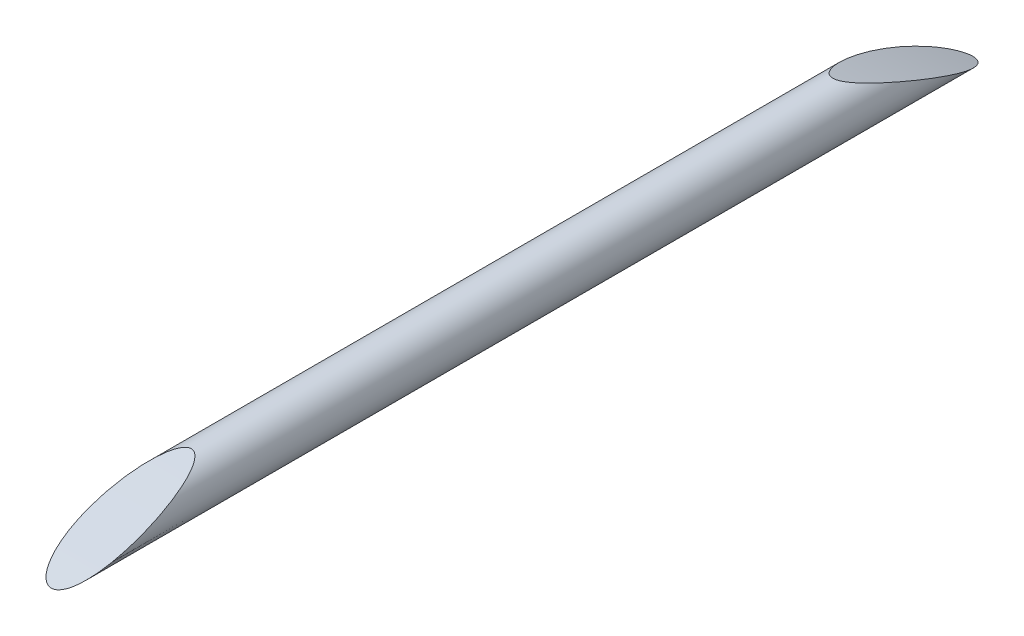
ISO-10303-21;
HEADER;
FILE_DESCRIPTION(('STEP AP214'),'2;1');
FILE_NAME('part.step','',(''),(''),'','','');
FILE_SCHEMA(('AUTOMOTIVE_DESIGN { 1 0 10303 214 1 1 1 1 }'));
ENDSEC;
DATA;
#1=APPLICATION_CONTEXT('core data for automotive mechanical design processes');
#2=APPLICATION_PROTOCOL_DEFINITION('international standard','automotive_design',2000,#1);
#3=PRODUCT_CONTEXT('',#1,'mechanical');
#4=PRODUCT('Part','Part','',(#3));
#5=PRODUCT_RELATED_PRODUCT_CATEGORY('part','',(#4));
#6=PRODUCT_DEFINITION_FORMATION('','',#4);
#7=PRODUCT_DEFINITION_CONTEXT('part definition',#1,'design');
#8=PRODUCT_DEFINITION('design','',#6,#7);
#9=PRODUCT_DEFINITION_SHAPE('','',#8);
#10=(LENGTH_UNIT() NAMED_UNIT(*) SI_UNIT(.MILLI.,.METRE.));
#11=(NAMED_UNIT(*) PLANE_ANGLE_UNIT() SI_UNIT($,.RADIAN.));
#12=(NAMED_UNIT(*) SI_UNIT($,.STERADIAN.) SOLID_ANGLE_UNIT());
#13=UNCERTAINTY_MEASURE_WITH_UNIT(LENGTH_MEASURE(1.E-05),#10,'distance_accuracy_value','');
#14=(GEOMETRIC_REPRESENTATION_CONTEXT(3) GLOBAL_UNCERTAINTY_ASSIGNED_CONTEXT((#13)) GLOBAL_UNIT_ASSIGNED_CONTEXT((#10,
#11,#12)) REPRESENTATION_CONTEXT('',''));
#15=CARTESIAN_POINT('',(0.,0.,0.));
#16=DIRECTION('',(0.,0.,1.));
#17=DIRECTION('',(1.,0.,0.));
#18=AXIS2_PLACEMENT_3D('',#15,#16,#17);
#19=CARTESIAN_POINT('',(0.,0.,10.5));
#20=DIRECTION('',(0.,0.,-1.));
#21=DIRECTION('',(-1.,0.,0.));
#22=AXIS2_PLACEMENT_3D('',#19,#20,#21);
#23=CYLINDRICAL_SURFACE('',#22,0.5);
#24=CARTESIAN_POINT('',(-0.5,0.,7.81348853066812));
#25=CARTESIAN_POINT('',(-0.500001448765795,0.0291573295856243,7.73475115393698));
#26=CARTESIAN_POINT('',(-0.497465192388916,0.0578744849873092,7.65584777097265));
#27=CARTESIAN_POINT('',(-0.487597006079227,0.11432442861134,7.49800798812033));
#28=CARTESIAN_POINT('',(-0.48026587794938,0.142057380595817,7.41907159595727));
#29=CARTESIAN_POINT('',(-0.46063378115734,0.196628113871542,7.26094847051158));
#30=CARTESIAN_POINT('',(-0.448302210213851,0.223459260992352,7.1817632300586));
#31=CARTESIAN_POINT('',(-0.418091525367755,0.275902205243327,7.02413147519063));
#32=CARTESIAN_POINT('',(-0.400220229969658,0.301515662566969,6.94568407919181));
#33=CARTESIAN_POINT('',(-0.367957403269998,0.338935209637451,6.82894699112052));
#34=CARTESIAN_POINT('',(-0.356254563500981,0.351273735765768,6.79008609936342));
#35=CARTESIAN_POINT('',(-0.330563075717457,0.375556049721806,6.7128923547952));
#36=CARTESIAN_POINT('',(-0.316569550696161,0.387498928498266,6.67456082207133));
#37=CARTESIAN_POINT('',(-0.285748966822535,0.410756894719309,6.59921824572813));
#38=CARTESIAN_POINT('',(-0.268947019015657,0.422076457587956,6.56219874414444));
#39=CARTESIAN_POINT('',(-0.240598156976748,0.438439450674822,6.50821051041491));
#40=CARTESIAN_POINT('',(-0.230644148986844,0.443782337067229,6.49050060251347));
#41=CARTESIAN_POINT('',(-0.209393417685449,0.454197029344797,6.45583050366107));
#42=CARTESIAN_POINT('',(-0.198098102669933,0.459269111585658,6.43886955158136));
#43=CARTESIAN_POINT('',(-0.173629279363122,0.46907284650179,6.40595294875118));
#44=CARTESIAN_POINT('',(-0.16043786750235,0.473800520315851,6.39000925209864));
#45=CARTESIAN_POINT('',(-0.131668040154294,0.482585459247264,6.36027398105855));
#46=CARTESIAN_POINT('',(-0.116107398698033,0.486647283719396,6.34646780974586));
#47=CARTESIAN_POINT('',(-0.0914505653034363,0.491625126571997,6.32950276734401));
#48=CARTESIAN_POINT('',(-0.0835964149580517,0.493031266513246,6.32470327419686));
#49=CARTESIAN_POINT('',(-0.0672596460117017,0.495524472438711,6.31618509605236));
#50=CARTESIAN_POINT('',(-0.0587769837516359,0.496611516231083,6.31246648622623));
#51=CARTESIAN_POINT('',(-0.0411612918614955,0.49838212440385,6.3064057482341));
#52=CARTESIAN_POINT('',(-0.0320216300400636,0.499060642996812,6.30408083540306));
#53=CARTESIAN_POINT('',(-0.013449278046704,0.499905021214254,6.30118717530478));
#54=CARTESIAN_POINT('',(-0.00401712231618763,0.500071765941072,6.30061539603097));
#55=CARTESIAN_POINT('',(0.0136701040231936,0.499882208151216,6.30126516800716));
#56=CARTESIAN_POINT('',(0.0219340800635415,0.499584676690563,6.30228521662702));
#57=CARTESIAN_POINT('',(0.0381699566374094,0.498607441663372,6.30563344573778));
#58=CARTESIAN_POINT('',(0.0461415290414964,0.497927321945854,6.30796305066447));
#59=CARTESIAN_POINT('',(0.0645042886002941,0.495936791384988,6.31477496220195));
#60=CARTESIAN_POINT('',(0.0747008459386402,0.49448633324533,6.31973466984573));
#61=CARTESIAN_POINT('',(0.0941618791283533,0.491153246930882,6.33111260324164));
#62=CARTESIAN_POINT('',(0.103423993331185,0.489269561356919,6.33753439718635));
#63=CARTESIAN_POINT('',(0.128190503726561,0.483566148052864,6.3569399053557));
#64=CARTESIAN_POINT('',(0.14272321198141,0.479407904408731,6.37104681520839));
#65=CARTESIAN_POINT('',(0.169665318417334,0.470546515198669,6.40098514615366));
#66=CARTESIAN_POINT('',(0.18206788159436,0.465841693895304,6.41682186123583));
#67=CARTESIAN_POINT('',(0.211578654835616,0.453446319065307,6.4583643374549));
#68=CARTESIAN_POINT('',(0.227594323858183,0.44551950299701,6.48476721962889));
#69=CARTESIAN_POINT('',(0.257083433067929,0.429173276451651,6.53883186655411));
#70=CARTESIAN_POINT('',(0.270550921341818,0.420752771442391,6.56649639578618));
#71=CARTESIAN_POINT('',(0.295646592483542,0.403516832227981,6.62272138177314));
#72=CARTESIAN_POINT('',(0.307264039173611,0.394699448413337,6.65128599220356));
#73=CARTESIAN_POINT('',(0.328967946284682,0.376798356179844,6.7088623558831));
#74=CARTESIAN_POINT('',(0.33905600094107,0.367714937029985,6.73787360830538));
#75=CARTESIAN_POINT('',(0.363256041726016,0.344192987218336,6.81246121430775));
#76=CARTESIAN_POINT('',(0.376483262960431,0.32958732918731,6.85827172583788));
#77=CARTESIAN_POINT('',(0.40053203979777,0.299894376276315,6.95036837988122));
#78=CARTESIAN_POINT('',(0.41135274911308,0.284806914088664,6.99665468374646));
#79=CARTESIAN_POINT('',(0.440779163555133,0.238845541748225,7.13610338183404));
#80=CARTESIAN_POINT('',(0.456304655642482,0.207318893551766,7.2297087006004));
#81=CARTESIAN_POINT('',(0.480375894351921,0.142866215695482,7.4169465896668));
#82=CARTESIAN_POINT('',(0.488944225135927,0.109945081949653,7.51057807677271));
#83=CARTESIAN_POINT('',(0.49933113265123,0.0427370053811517,7.69773825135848));
#84=CARTESIAN_POINT('',(0.501150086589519,0.00845013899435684,7.7912669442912));
#85=CARTESIAN_POINT('',(0.497784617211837,-0.0550330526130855,7.96094278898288));
#86=CARTESIAN_POINT('',(0.493802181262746,-0.0840344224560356,8.03718748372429));
#87=CARTESIAN_POINT('',(0.480147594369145,-0.142729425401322,8.18901450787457));
#88=CARTESIAN_POINT('',(0.470470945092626,-0.172423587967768,8.2645962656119));
#89=CARTESIAN_POINT('',(0.45027242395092,-0.218057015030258,8.37894755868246));
#90=CARTESIAN_POINT('',(0.442313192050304,-0.233861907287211,8.41822671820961));
#91=CARTESIAN_POINT('',(0.424080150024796,-0.265500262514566,8.49622611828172));
#92=CARTESIAN_POINT('',(0.413807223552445,-0.28133371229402,8.53494656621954));
#93=CARTESIAN_POINT('',(0.390477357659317,-0.312910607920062,8.61156646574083));
#94=CARTESIAN_POINT('',(0.377421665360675,-0.328654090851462,8.64946627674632));
#95=CARTESIAN_POINT('',(0.347819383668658,-0.359840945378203,8.72398115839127));
#96=CARTESIAN_POINT('',(0.331278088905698,-0.375284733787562,8.76059808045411));
#97=CARTESIAN_POINT('',(0.296744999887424,-0.402920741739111,8.82566387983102));
#98=CARTESIAN_POINT('',(0.279473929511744,-0.415220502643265,8.85444545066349));
#99=CARTESIAN_POINT('',(0.240711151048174,-0.438833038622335,8.90940169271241));
#100=CARTESIAN_POINT('',(0.219243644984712,-0.450150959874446,8.93559007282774));
#101=CARTESIAN_POINT('',(0.184263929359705,-0.464949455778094,8.96968174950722));
#102=CARTESIAN_POINT('',(0.173068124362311,-0.469257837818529,8.97958506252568));
#103=CARTESIAN_POINT('',(0.149414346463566,-0.477317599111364,8.99807948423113));
#104=CARTESIAN_POINT('',(0.13695511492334,-0.481068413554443,9.00666926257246));
#105=CARTESIAN_POINT('',(0.110538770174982,-0.487821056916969,9.02211225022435));
#106=CARTESIAN_POINT('',(0.0965631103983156,-0.490811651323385,9.02893943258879));
#107=CARTESIAN_POINT('',(0.0674345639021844,-0.495649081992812,9.03997314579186));
#108=CARTESIAN_POINT('',(0.0522858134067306,-0.49749974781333,9.04418845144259));
#109=CARTESIAN_POINT('',(0.0254925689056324,-0.499479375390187,9.04869637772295));
#110=CARTESIAN_POINT('',(0.0139969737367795,-0.499936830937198,9.04973751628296));
#111=CARTESIAN_POINT('',(-0.0090201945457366,-0.500050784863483,9.04999691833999));
#112=CARTESIAN_POINT('',(-0.0205417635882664,-0.499707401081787,9.04921545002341));
#113=CARTESIAN_POINT('',(-0.0432373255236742,-0.498256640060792,9.04591212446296));
#114=CARTESIAN_POINT('',(-0.0544123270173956,-0.497151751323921,9.04339593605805));
#115=CARTESIAN_POINT('',(-0.0762163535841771,-0.494279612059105,9.03684981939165));
#116=CARTESIAN_POINT('',(-0.0868449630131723,-0.492511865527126,9.03281875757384));
#117=CARTESIAN_POINT('',(-0.112816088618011,-0.487368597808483,9.02107774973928));
#118=CARTESIAN_POINT('',(-0.127714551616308,-0.483635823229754,9.0125465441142));
#119=CARTESIAN_POINT('',(-0.155888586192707,-0.475305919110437,8.99346806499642));
#120=CARTESIAN_POINT('',(-0.169159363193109,-0.470706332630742,8.98291505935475));
#121=CARTESIAN_POINT('',(-0.203767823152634,-0.457212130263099,8.95187924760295));
#122=CARTESIAN_POINT('',(-0.223557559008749,-0.447713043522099,8.92995207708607));
#123=CARTESIAN_POINT('',(-0.259619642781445,-0.427809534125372,8.88378133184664));
#124=CARTESIAN_POINT('',(-0.275882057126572,-0.417402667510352,8.85953148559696));
#125=CARTESIAN_POINT('',(-0.307073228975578,-0.395103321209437,8.80730018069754));
#126=CARTESIAN_POINT('',(-0.321735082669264,-0.383162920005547,8.77918182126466));
#127=CARTESIAN_POINT('',(-0.348516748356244,-0.358970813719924,8.72187502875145));
#128=CARTESIAN_POINT('',(-0.360633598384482,-0.346718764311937,8.69268539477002));
#129=CARTESIAN_POINT('',(-0.393946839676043,-0.309706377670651,8.60396617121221));
#130=CARTESIAN_POINT('',(-0.412059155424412,-0.284726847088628,8.54337285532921));
#131=CARTESIAN_POINT('',(-0.440665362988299,-0.237646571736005,8.4277019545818));
#132=CARTESIAN_POINT('',(-0.451787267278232,-0.21553824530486,8.37277113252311));
#133=CARTESIAN_POINT('',(-0.470262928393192,-0.171532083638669,8.26216004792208));
#134=CARTESIAN_POINT('',(-0.477614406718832,-0.149634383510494,8.20647935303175));
#135=CARTESIAN_POINT('',(-0.489104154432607,-0.106207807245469,8.09474086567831));
#136=CARTESIAN_POINT('',(-0.493246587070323,-0.0846784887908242,8.03868365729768));
#137=CARTESIAN_POINT('',(-0.498694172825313,-0.0420240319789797,7.92627559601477));
#138=CARTESIAN_POINT('',(-0.499998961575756,-0.0208989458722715,7.86992470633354));
#139=CARTESIAN_POINT('',(-0.5,0.,7.81348853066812));
#140=B_SPLINE_CURVE_WITH_KNOTS('',3,(#24,#25,#26,#27,#28,#29,#30,#31,#32,#33,#34,#35,#36,#37,
#38,#39,#40,#41,#42,#43,#44,#45,#46,#47,#48,#49,#50,#51,#52,#53,#54,#55,#56,#57,#58,#59,#60,#61,
#62,#63,#64,#65,#66,#67,#68,#69,#70,#71,#72,#73,#74,#75,#76,#77,#78,#79,#80,#81,#82,#83,#84,#85,
#86,#87,#88,#89,#90,#91,#92,#93,#94,#95,#96,#97,#98,#99,#100,#101,#102,#103,#104,#105,#106,#107,
#108,#109,#110,#111,#112,#113,#114,#115,#116,#117,#118,#119,#120,#121,#122,#123,#124,#125,#126,
#127,#128,#129,#130,#131,#132,#133,#134,#135,#136,#137,#138,#139),.UNSPECIFIED.,.T.,.F.,(4,2,2,
2,2,2,2,2,2,2,2,2,2,2,2,2,2,2,2,2,2,2,2,2,2,2,2,2,2,2,2,2,2,2,2,2,2,2,2,2,2,2,2,2,2,2,2,2,2,2,2,
2,2,2,2,2,2,4),(0.,0.251859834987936,0.503677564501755,0.757060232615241,1.01008690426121,
1.13729267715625,1.26477288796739,1.39116889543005,1.45414921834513,1.51706399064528,
1.58061748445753,1.64371576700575,1.67158102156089,1.69944821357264,1.72765289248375,
1.75580876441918,1.78067871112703,1.80557576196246,1.83967454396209,1.87385745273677,
1.93553646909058,1.99740984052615,2.09281557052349,2.1884414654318,2.28460352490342,
2.38066464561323,2.53018231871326,2.6797524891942,2.97937197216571,3.27801490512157,
3.5766411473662,3.82149991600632,4.06655237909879,4.19574643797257,4.32489123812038,
4.45397828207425,4.58287063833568,4.68992252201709,4.79637431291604,4.84295482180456,
4.88958219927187,4.93686310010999,4.98398428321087,5.0184770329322,5.05296470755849,
5.08734021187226,5.12174149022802,5.17414641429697,5.22670217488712,5.31925926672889,
5.41207372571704,5.51356711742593,5.61517798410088,5.81871252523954,5.99933944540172,
6.18007539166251,6.36057646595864,6.54110071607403),.UNSPECIFIED.);
#141=CARTESIAN_POINT('',(-0.5,0.,7.81348853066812));
#142=VERTEX_POINT('',#141);
#143=EDGE_CURVE('E10',#142,#142,#140,.T.);
#144=ORIENTED_EDGE('',*,*,#143,.T.);
#145=EDGE_LOOP('',(#144));
#146=FACE_BOUND('',#145,.T.);
#147=CARTESIAN_POINT('',(-0.5,0.,-7.81348853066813));
#148=CARTESIAN_POINT('',(-0.499998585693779,-0.0247696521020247,-7.8803773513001));
#149=CARTESIAN_POINT('',(-0.498168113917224,-0.0498572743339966,-7.94714693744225));
#150=CARTESIAN_POINT('',(-0.490451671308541,-0.10057849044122,-8.08021742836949));
#151=CARTESIAN_POINT('',(-0.484567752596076,-0.126211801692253,-8.14651855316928));
#152=CARTESIAN_POINT('',(-0.468076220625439,-0.17787611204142,-8.27829976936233));
#153=CARTESIAN_POINT('',(-0.457474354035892,-0.203906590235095,-8.34378076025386));
#154=CARTESIAN_POINT('',(-0.430425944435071,-0.256129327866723,-8.47339344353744));
#155=CARTESIAN_POINT('',(-0.413988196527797,-0.282321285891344,-8.53752701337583));
#156=CARTESIAN_POINT('',(-0.377896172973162,-0.328396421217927,-8.64891093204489));
#157=CARTESIAN_POINT('',(-0.359863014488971,-0.348338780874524,-8.69663793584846));
#158=CARTESIAN_POINT('',(-0.327998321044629,-0.377652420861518,-8.76614839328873));
#159=CARTESIAN_POINT('',(-0.316603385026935,-0.387303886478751,-8.78892592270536));
#160=CARTESIAN_POINT('',(-0.291853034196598,-0.406283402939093,-8.83352001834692));
#161=CARTESIAN_POINT('',(-0.278499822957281,-0.415611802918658,-8.85533762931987));
#162=CARTESIAN_POINT('',(-0.253854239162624,-0.430926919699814,-8.891009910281));
#163=CARTESIAN_POINT('',(-0.243199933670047,-0.437055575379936,-8.90524206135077));
#164=CARTESIAN_POINT('',(-0.220492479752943,-0.44894066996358,-8.93276834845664));
#165=CARTESIAN_POINT('',(-0.208437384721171,-0.454696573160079,-8.94606113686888));
#166=CARTESIAN_POINT('',(-0.182578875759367,-0.465687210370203,-8.97138209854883));
#167=CARTESIAN_POINT('',(-0.16875998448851,-0.470916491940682,-8.98339710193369));
#168=CARTESIAN_POINT('',(-0.139240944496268,-0.480469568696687,-9.00530223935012));
#169=CARTESIAN_POINT('',(-0.12354590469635,-0.484795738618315,-9.01519794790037));
#170=CARTESIAN_POINT('',(-0.0959642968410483,-0.490832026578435,-9.02898599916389));
#171=CARTESIAN_POINT('',(-0.0846147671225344,-0.492930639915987,-9.03377363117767));
#172=CARTESIAN_POINT('',(-0.0612255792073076,-0.496377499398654,-9.04163214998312));
#173=CARTESIAN_POINT('',(-0.049186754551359,-0.497726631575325,-9.04470506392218));
#174=CARTESIAN_POINT('',(-0.0246020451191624,-0.4995472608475,-9.04885100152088));
#175=CARTESIAN_POINT('',(-0.0120530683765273,-0.500012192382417,-9.04990906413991));
#176=CARTESIAN_POINT('',(0.0130399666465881,-0.4999873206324,-9.04985245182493));
#177=CARTESIAN_POINT('',(0.0255840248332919,-0.499497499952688,-9.04873773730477));
#178=CARTESIAN_POINT('',(0.0491366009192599,-0.497707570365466,-9.04466161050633));
#179=CARTESIAN_POINT('',(0.0601822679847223,-0.496483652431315,-9.04187382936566));
#180=CARTESIAN_POINT('',(0.0817006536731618,-0.493399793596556,-9.03484353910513));
#181=CARTESIAN_POINT('',(0.0921730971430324,-0.491539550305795,-9.03060033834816));
#182=CARTESIAN_POINT('',(0.118306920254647,-0.486077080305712,-9.01812669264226));
#183=CARTESIAN_POINT('',(0.13346271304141,-0.482089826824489,-9.00901001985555));
#184=CARTESIAN_POINT('',(0.162062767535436,-0.4732450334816,-8.9887412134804));
#185=CARTESIAN_POINT('',(0.175501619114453,-0.46838485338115,-8.97758290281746));
#186=CARTESIAN_POINT('',(0.210839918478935,-0.454035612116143,-8.94455453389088));
#187=CARTESIAN_POINT('',(0.231055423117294,-0.443918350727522,-8.92117561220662));
#188=CARTESIAN_POINT('',(0.267774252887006,-0.422781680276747,-8.87207745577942));
#189=CARTESIAN_POINT('',(0.284267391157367,-0.41175990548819,-8.8463520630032));
#190=CARTESIAN_POINT('',(0.316008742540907,-0.388035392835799,-8.79067342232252));
#191=CARTESIAN_POINT('',(0.33093558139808,-0.375278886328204,-8.76056214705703));
#192=CARTESIAN_POINT('',(0.358079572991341,-0.349468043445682,-8.69925075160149));
#193=CARTESIAN_POINT('',(0.370293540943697,-0.336413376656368,-8.66804940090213));
#194=CARTESIAN_POINT('',(0.403706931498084,-0.297014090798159,-8.57326677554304));
#195=CARTESIAN_POINT('',(0.421623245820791,-0.270479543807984,-8.5086131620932));
#196=CARTESIAN_POINT('',(0.454125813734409,-0.212321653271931,-8.36495946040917));
#197=CARTESIAN_POINT('',(0.467347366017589,-0.18073252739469,-8.2856566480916));
#198=CARTESIAN_POINT('',(0.486940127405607,-0.118157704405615,-8.12589757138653));
#199=CARTESIAN_POINT('',(0.493302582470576,-0.0871728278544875,-8.04543996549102));
#200=CARTESIAN_POINT('',(0.500268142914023,-0.0260403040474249,-7.88392503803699));
#201=CARTESIAN_POINT('',(0.500868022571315,0.00410686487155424,-7.80286740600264));
#202=CARTESIAN_POINT('',(0.496850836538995,0.0633992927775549,-7.64059085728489));
#203=CARTESIAN_POINT('',(0.492237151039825,0.0925451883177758,-7.5593720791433));
#204=CARTESIAN_POINT('',(0.475916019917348,0.157964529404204,-7.37372829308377));
#205=CARTESIAN_POINT('',(0.462556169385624,0.193890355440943,-7.26931474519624));
#206=CARTESIAN_POINT('',(0.435589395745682,0.246257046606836,-7.11344138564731));
#207=CARTESIAN_POINT('',(0.425449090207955,0.263455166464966,-7.06161989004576));
#208=CARTESIAN_POINT('',(0.402531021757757,0.297302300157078,-6.95838711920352));
#209=CARTESIAN_POINT('',(0.389754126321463,0.313951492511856,-6.90697571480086));
#210=CARTESIAN_POINT('',(0.360988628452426,0.346643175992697,-6.80478933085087));
#211=CARTESIAN_POINT('',(0.344996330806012,0.362684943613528,-6.75401515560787));
#212=CARTESIAN_POINT('',(0.308833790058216,0.393956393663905,-6.65382351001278));
#213=CARTESIAN_POINT('',(0.288676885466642,0.409188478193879,-6.60440226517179));
#214=CARTESIAN_POINT('',(0.255045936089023,0.430225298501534,-6.53534283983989));
#215=CARTESIAN_POINT('',(0.244188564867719,0.436514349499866,-6.5145856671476));
#216=CARTESIAN_POINT('',(0.220783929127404,0.448810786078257,-6.4737960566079));
#217=CARTESIAN_POINT('',(0.208229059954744,0.454816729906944,-6.45376742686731));
#218=CARTESIAN_POINT('',(0.180710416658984,0.466446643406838,-6.41479827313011));
#219=CARTESIAN_POINT('',(0.165711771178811,0.472063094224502,-6.39587989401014));
#220=CARTESIAN_POINT('',(0.132527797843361,0.482427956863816,-6.36081535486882));
#221=CARTESIAN_POINT('',(0.11437368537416,0.487184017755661,-6.34464485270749));
#222=CARTESIAN_POINT('',(0.0865667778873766,0.49250757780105,-6.32649156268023));
#223=CARTESIAN_POINT('',(0.0787397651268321,0.493829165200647,-6.32197838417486));
#224=CARTESIAN_POINT('',(0.0624921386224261,0.496147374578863,-6.31405475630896));
#225=CARTESIAN_POINT('',(0.0540718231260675,0.497144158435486,-6.31064375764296));
#226=CARTESIAN_POINT('',(0.036638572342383,0.498733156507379,-6.30520325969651));
#227=CARTESIAN_POINT('',(0.0276199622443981,0.499320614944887,-6.30319000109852));
#228=CARTESIAN_POINT('',(0.00934827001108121,0.499995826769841,-6.30087582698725));
#229=CARTESIAN_POINT('',(9.54702561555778E-05,0.500084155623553,-6.30057293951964));
#230=CARTESIAN_POINT('',(-0.017271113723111,0.499768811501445,-6.30165387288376));
#231=CARTESIAN_POINT('',(-0.0253981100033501,0.499418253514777,-6.30285560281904));
#232=CARTESIAN_POINT('',(-0.0413407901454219,0.498352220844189,-6.30650762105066));
#233=CARTESIAN_POINT('',(-0.0491561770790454,0.497636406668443,-6.30895907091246));
#234=CARTESIAN_POINT('',(-0.0675544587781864,0.49553485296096,-6.31614957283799));
#235=CARTESIAN_POINT('',(-0.0779104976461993,0.493993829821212,-6.3214175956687));
#236=CARTESIAN_POINT('',(-0.0976459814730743,0.490475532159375,-6.33342366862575));
#237=CARTESIAN_POINT('',(-0.107022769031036,0.488497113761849,-6.34016557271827));
#238=CARTESIAN_POINT('',(-0.132334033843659,0.482465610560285,-6.36067700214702));
#239=CARTESIAN_POINT('',(-0.147218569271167,0.478057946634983,-6.37561959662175));
#240=CARTESIAN_POINT('',(-0.174766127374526,0.468686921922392,-6.40725061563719));
#241=CARTESIAN_POINT('',(-0.187421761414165,0.463721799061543,-6.42394456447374));
#242=CARTESIAN_POINT('',(-0.217804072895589,0.450525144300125,-6.46811274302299));
#243=CARTESIAN_POINT('',(-0.234331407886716,0.442039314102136,-6.49632721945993));
#244=CARTESIAN_POINT('',(-0.264689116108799,0.424550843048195,-6.5540404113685));
#245=CARTESIAN_POINT('',(-0.278513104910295,0.415547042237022,-6.58354197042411));
#246=CARTESIAN_POINT('',(-0.304203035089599,0.397128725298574,-6.64343622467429));
#247=CARTESIAN_POINT('',(-0.316059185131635,0.387712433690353,-6.67383253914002));
#248=CARTESIAN_POINT('',(-0.338155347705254,0.36859659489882,-6.73507072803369));
#249=CARTESIAN_POINT('',(-0.348397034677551,0.358897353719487,-6.76591210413));
#250=CARTESIAN_POINT('',(-0.370774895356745,0.335950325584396,-6.83832515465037));
#251=CARTESIAN_POINT('',(-0.382393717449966,0.32260383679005,-6.88002504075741));
#252=CARTESIAN_POINT('',(-0.403687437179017,0.295519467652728,-6.96379487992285));
#253=CARTESIAN_POINT('',(-0.413361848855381,0.281781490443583,-7.0058649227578));
#254=CARTESIAN_POINT('',(-0.439881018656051,0.239999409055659,-7.1325348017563));
#255=CARTESIAN_POINT('',(-0.454192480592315,0.211418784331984,-7.21749446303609));
#256=CARTESIAN_POINT('',(-0.477030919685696,0.153030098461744,-7.38765769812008));
#257=CARTESIAN_POINT('',(-0.485562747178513,0.123223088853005,-7.47286100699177));
#258=CARTESIAN_POINT('',(-0.497049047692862,0.0624488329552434,-7.64326992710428));
#259=CARTESIAN_POINT('',(-0.500001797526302,0.0314812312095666,-7.72847553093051));
#260=CARTESIAN_POINT('',(-0.5,0.,-7.81348853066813));
#261=B_SPLINE_CURVE_WITH_KNOTS('',3,(#147,#148,#149,#150,#151,#152,#153,#154,#155,#156,#157,
#158,#159,#160,#161,#162,#163,#164,#165,#166,#167,#168,#169,#170,#171,#172,#173,#174,#175,#176,
#177,#178,#179,#180,#181,#182,#183,#184,#185,#186,#187,#188,#189,#190,#191,#192,#193,#194,#195,
#196,#197,#198,#199,#200,#201,#202,#203,#204,#205,#206,#207,#208,#209,#210,#211,#212,#213,#214,
#215,#216,#217,#218,#219,#220,#221,#222,#223,#224,#225,#226,#227,#228,#229,#230,#231,#232,#233,
#234,#235,#236,#237,#238,#239,#240,#241,#242,#243,#244,#245,#246,#247,#248,#249,#250,#251,#252,
#253,#254,#255,#256,#257,#258,#259,#260),.UNSPECIFIED.,.T.,.F.,(4,2,2,2,2,2,2,2,2,2,2,2,2,2,2,2,
2,2,2,2,2,2,2,2,2,2,2,2,2,2,2,2,2,2,2,2,2,2,2,2,2,2,2,2,2,2,2,2,2,2,2,2,2,2,2,2,4),(0.,
0.213951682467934,0.427795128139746,0.641378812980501,0.854641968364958,1.01862230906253,
1.10026817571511,1.18182286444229,1.2381786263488,1.29461366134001,1.3515832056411,
1.40840100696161,1.44575614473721,1.48306702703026,1.52065389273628,1.55824144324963,
1.59247551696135,1.6267258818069,1.68080320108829,1.73504692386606,1.83206078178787,
1.92933699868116,2.03700826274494,2.1448052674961,2.36077932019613,2.61957748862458,
2.87870556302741,3.13797868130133,3.39708379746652,3.73034943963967,3.89690589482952,
4.06340763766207,4.23010183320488,4.39627019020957,4.46898950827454,4.54204612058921,
4.61625502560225,4.68976775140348,4.71708921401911,4.74439703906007,4.7720170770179,
4.79960526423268,4.82415503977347,4.84872767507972,4.88368885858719,4.91874257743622,
4.98301941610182,5.04750547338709,5.1485966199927,5.24992370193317,5.35174074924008,
5.45345149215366,5.58928915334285,5.72516072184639,5.99722936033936,6.26906939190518,
6.54099337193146),.UNSPECIFIED.);
#262=CARTESIAN_POINT('',(-0.5,0.,-7.81348853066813));
#263=VERTEX_POINT('',#262);
#264=EDGE_CURVE('E40',#263,#263,#261,.T.);
#265=ORIENTED_EDGE('',*,*,#264,.T.);
#266=EDGE_LOOP('',(#265));
#267=FACE_BOUND('',#266,.T.);
#268=ADVANCED_FACE('F31',(#146,#267),#23,.T.);
#269=CARTESIAN_POINT('',(21.,-21.0997487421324,0.));
#270=DIRECTION('',(-1.,0.,0.));
#271=DIRECTION('',(0.,0.,1.));
#272=AXIS2_PLACEMENT_3D('',#269,#270,#271);
#273=CYLINDRICAL_SURFACE('',#272,22.5);
#274=ORIENTED_EDGE('',*,*,#264,.F.);
#275=EDGE_LOOP('',(#274));
#276=FACE_BOUND('',#275,.T.);
#277=ADVANCED_FACE('F51',(#276),#273,.T.);
#278=ORIENTED_EDGE('',*,*,#143,.F.);
#279=EDGE_LOOP('',(#278));
#280=FACE_BOUND('',#279,.T.);
#281=ADVANCED_FACE('F48',(#280),#273,.T.);
#282=CLOSED_SHELL('',(#268,#277,#281));
#283=MANIFOLD_SOLID_BREP('B2',#282);
#284=ADVANCED_BREP_SHAPE_REPRESENTATION('',(#18,#283),#14);
#285=SHAPE_DEFINITION_REPRESENTATION(#9,#284);
ENDSEC;
END-ISO-10303-21;
